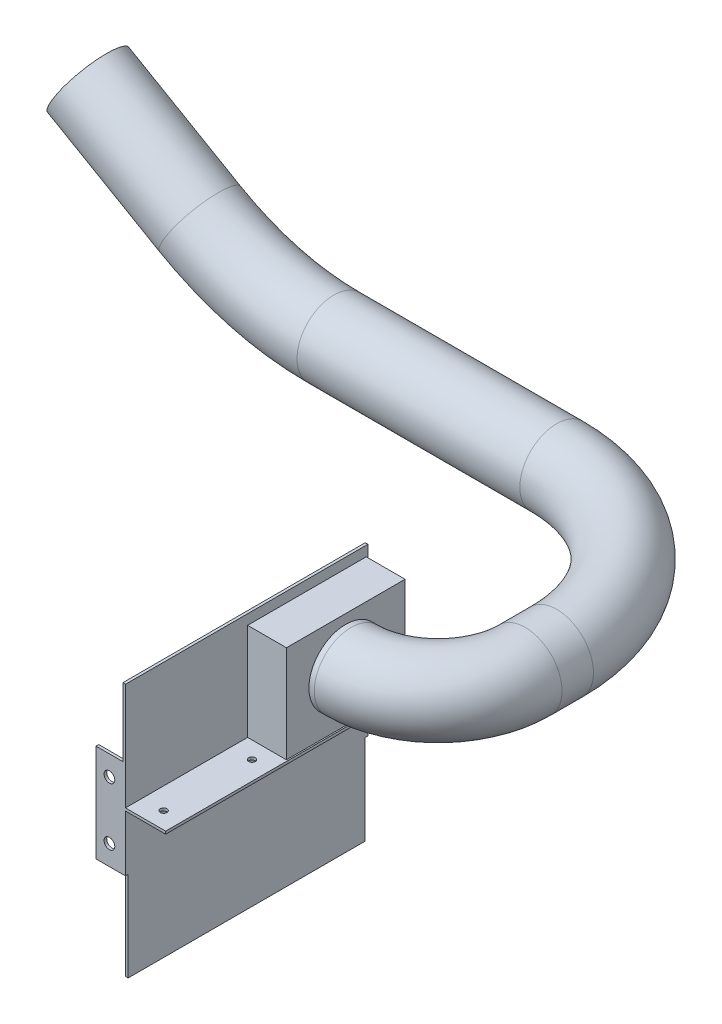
ISO-10303-21;
HEADER;
FILE_DESCRIPTION(('STEP AP214'),'2;1');
FILE_NAME('part.step','',(''),(''),'','','');
FILE_SCHEMA(('AUTOMOTIVE_DESIGN { 1 0 10303 214 1 1 1 1 }'));
ENDSEC;
DATA;
#1=APPLICATION_CONTEXT('core data for automotive mechanical design processes');
#2=APPLICATION_PROTOCOL_DEFINITION('international standard','automotive_design',2000,#1);
#3=PRODUCT_CONTEXT('',#1,'mechanical');
#4=PRODUCT('Part','Part','',(#3));
#5=PRODUCT_RELATED_PRODUCT_CATEGORY('part','',(#4));
#6=PRODUCT_DEFINITION_FORMATION('','',#4);
#7=PRODUCT_DEFINITION_CONTEXT('part definition',#1,'design');
#8=PRODUCT_DEFINITION('design','',#6,#7);
#9=PRODUCT_DEFINITION_SHAPE('','',#8);
#10=(LENGTH_UNIT() NAMED_UNIT(*) SI_UNIT(.MILLI.,.METRE.));
#11=(NAMED_UNIT(*) PLANE_ANGLE_UNIT() SI_UNIT($,.RADIAN.));
#12=(NAMED_UNIT(*) SI_UNIT($,.STERADIAN.) SOLID_ANGLE_UNIT());
#13=UNCERTAINTY_MEASURE_WITH_UNIT(LENGTH_MEASURE(1.E-05),#10,'distance_accuracy_value','');
#14=(GEOMETRIC_REPRESENTATION_CONTEXT(3) GLOBAL_UNCERTAINTY_ASSIGNED_CONTEXT((#13)) GLOBAL_UNIT_ASSIGNED_CONTEXT((#10,
#11,#12)) REPRESENTATION_CONTEXT('',''));
#15=CARTESIAN_POINT('',(0.,0.,0.));
#16=DIRECTION('',(0.,0.,1.));
#17=DIRECTION('',(1.,0.,0.));
#18=AXIS2_PLACEMENT_3D('',#15,#16,#17);
#19=CARTESIAN_POINT('',(31.,43.5,-0.7));
#20=DIRECTION('',(-1.,0.,0.));
#21=DIRECTION('',(0.,0.,1.));
#22=AXIS2_PLACEMENT_3D('',#19,#20,#21);
#23=PLANE('',#22);
#24=DIRECTION('',(0.,0.,-1.));
#25=VECTOR('',#24,1.);
#26=CARTESIAN_POINT('',(31.,-29.,-0.7));
#27=LINE('',#26,#25);
#28=CARTESIAN_POINT('',(31.,-29.,-0.699999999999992));
#29=VERTEX_POINT('',#28);
#30=CARTESIAN_POINT('',(31.,-29.,-89.3));
#31=VERTEX_POINT('',#30);
#32=EDGE_CURVE('E31',#29,#31,#27,.T.);
#33=ORIENTED_EDGE('',*,*,#32,.T.);
#34=DIRECTION('',(0.,-1.,0.));
#35=VECTOR('',#34,1.);
#36=CARTESIAN_POINT('',(31.,43.5,-89.3));
#37=LINE('',#36,#35);
#38=CARTESIAN_POINT('',(31.,43.5,-89.3));
#39=VERTEX_POINT('',#38);
#40=EDGE_CURVE('E190',#39,#31,#37,.T.);
#41=ORIENTED_EDGE('',*,*,#40,.F.);
#42=DIRECTION('',(0.,0.,-1.));
#43=VECTOR('',#42,1.);
#44=CARTESIAN_POINT('',(31.,43.5,-0.7));
#45=LINE('',#44,#43);
#46=CARTESIAN_POINT('',(31.,43.5,-0.7));
#47=VERTEX_POINT('',#46);
#48=EDGE_CURVE('E176',#47,#39,#45,.T.);
#49=ORIENTED_EDGE('',*,*,#48,.F.);
#50=DIRECTION('',(0.,-1.,0.));
#51=VECTOR('',#50,1.);
#52=CARTESIAN_POINT('',(31.,43.5,-0.7));
#53=LINE('',#52,#51);
#54=EDGE_CURVE('E168',#47,#29,#53,.T.);
#55=ORIENTED_EDGE('',*,*,#54,.T.);
#56=EDGE_LOOP('',(#33,#41,#49,#55));
#57=FACE_BOUND('',#56,.T.);
#58=CARTESIAN_POINT('',(31.,9.,-45.));
#59=DIRECTION('',(1.,0.,0.));
#60=DIRECTION('',(0.,0.,-1.));
#61=AXIS2_PLACEMENT_3D('',#58,#59,#60);
#62=CIRCLE('',#61,27.5);
#63=CARTESIAN_POINT('',(31.,9.,-72.5));
#64=VERTEX_POINT('',#63);
#65=EDGE_CURVE('E9',#64,#64,#62,.T.);
#66=ORIENTED_EDGE('',*,*,#65,.F.);
#67=EDGE_LOOP('',(#66));
#68=FACE_BOUND('',#67,.T.);
#69=ADVANCED_FACE('F14',(#57,#68),#23,.F.);
#70=CARTESIAN_POINT('',(-183.30848316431,-29.,90.5));
#71=DIRECTION('',(0.,-1.,0.));
#72=DIRECTION('',(0.,0.,-1.));
#73=AXIS2_PLACEMENT_3D('',#70,#71,#72);
#74=PLANE('',#73);
#75=CARTESIAN_POINT('',(18.,-29.,12.));
#76=DIRECTION('',(0.,1.,0.));
#77=DIRECTION('',(0.,0.,1.));
#78=AXIS2_PLACEMENT_3D('',#75,#76,#77);
#79=CIRCLE('',#78,2.5);
#80=CARTESIAN_POINT('',(18.,-29.,14.5));
#81=VERTEX_POINT('',#80);
#82=EDGE_CURVE('E238',#81,#81,#79,.T.);
#83=ORIENTED_EDGE('',*,*,#82,.F.);
#84=EDGE_LOOP('',(#83));
#85=FACE_BOUND('',#84,.T.);
#86=CARTESIAN_POINT('',(18.,-29.,78.));
#87=DIRECTION('',(0.,1.,0.));
#88=DIRECTION('',(0.,0.,1.));
#89=AXIS2_PLACEMENT_3D('',#86,#87,#88);
#90=CIRCLE('',#89,2.5);
#91=CARTESIAN_POINT('',(18.,-29.,80.5));
#92=VERTEX_POINT('',#91);
#93=EDGE_CURVE('E241',#92,#92,#90,.T.);
#94=ORIENTED_EDGE('',*,*,#93,.F.);
#95=EDGE_LOOP('',(#94));
#96=FACE_BOUND('',#95,.T.);
#97=DIRECTION('',(1.,0.,0.));
#98=VECTOR('',#97,1.);
#99=CARTESIAN_POINT('',(2.,-29.,-0.699999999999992));
#100=LINE('',#99,#98);
#101=CARTESIAN_POINT('',(2.,-29.,-0.699999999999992));
#102=VERTEX_POINT('',#101);
#103=EDGE_CURVE('E813',#102,#29,#100,.T.);
#104=ORIENTED_EDGE('',*,*,#103,.F.);
#105=DIRECTION('',(0.,0.,-1.));
#106=VECTOR('',#105,1.);
#107=CARTESIAN_POINT('',(2.,-29.,90.5));
#108=LINE('',#107,#106);
#109=CARTESIAN_POINT('',(2.,-29.,90.5));
#110=VERTEX_POINT('',#109);
#111=EDGE_CURVE('E165',#110,#102,#108,.T.);
#112=ORIENTED_EDGE('',*,*,#111,.F.);
#113=DIRECTION('',(1.,0.,0.));
#114=VECTOR('',#113,1.);
#115=CARTESIAN_POINT('',(-183.30848316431,-29.,90.5));
#116=LINE('',#115,#114);
#117=CARTESIAN_POINT('',(32.,-29.,90.5));
#118=VERTEX_POINT('',#117);
#119=EDGE_CURVE('E437',#110,#118,#116,.T.);
#120=ORIENTED_EDGE('',*,*,#119,.T.);
#121=DIRECTION('',(0.,0.,1.));
#122=VECTOR('',#121,1.);
#123=CARTESIAN_POINT('',(32.,-29.,90.5));
#124=LINE('',#123,#122);
#125=CARTESIAN_POINT('',(32.,-29.,-90.5));
#126=VERTEX_POINT('',#125);
#127=EDGE_CURVE('E261',#126,#118,#124,.T.);
#128=ORIENTED_EDGE('',*,*,#127,.F.);
#129=DIRECTION('',(1.,0.,0.));
#130=VECTOR('',#129,1.);
#131=CARTESIAN_POINT('',(-183.30848316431,-29.,-90.5));
#132=LINE('',#131,#130);
#133=CARTESIAN_POINT('',(2.,-29.,-90.5));
#134=VERTEX_POINT('',#133);
#135=EDGE_CURVE('E266',#134,#126,#132,.T.);
#136=ORIENTED_EDGE('',*,*,#135,.F.);
#137=CARTESIAN_POINT('',(2.,-29.,-89.3));
#138=VERTEX_POINT('',#137);
#139=EDGE_CURVE('E167',#138,#134,#108,.T.);
#140=ORIENTED_EDGE('',*,*,#139,.F.);
#141=DIRECTION('',(-1.,0.,0.));
#142=VECTOR('',#141,1.);
#143=CARTESIAN_POINT('',(2.,-29.,-89.3));
#144=LINE('',#143,#142);
#145=EDGE_CURVE('E36',#31,#138,#144,.T.);
#146=ORIENTED_EDGE('',*,*,#145,.F.);
#147=ORIENTED_EDGE('',*,*,#32,.F.);
#148=EDGE_LOOP('',(#104,#112,#120,#128,#136,#140,#146,#147));
#149=FACE_BOUND('',#148,.T.);
#150=ADVANCED_FACE('F291',(#85,#96,#149),#74,.F.);
#151=CARTESIAN_POINT('',(2.,51.,90.5));
#152=DIRECTION('',(-1.,0.,0.));
#153=DIRECTION('',(0.,0.,1.));
#154=AXIS2_PLACEMENT_3D('',#151,#152,#153);
#155=PLANE('',#154);
#156=DIRECTION('',(0.,-1.,0.));
#157=VECTOR('',#156,1.);
#158=CARTESIAN_POINT('',(2.,43.5,-0.699999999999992));
#159=LINE('',#158,#157);
#160=CARTESIAN_POINT('',(2.,43.5,-0.699999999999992));
#161=VERTEX_POINT('',#160);
#162=EDGE_CURVE('E158',#161,#102,#159,.T.);
#163=ORIENTED_EDGE('',*,*,#162,.F.);
#164=DIRECTION('',(0.,0.,1.));
#165=VECTOR('',#164,1.);
#166=CARTESIAN_POINT('',(2.,43.5,-0.699999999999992));
#167=LINE('',#166,#165);
#168=CARTESIAN_POINT('',(2.,43.5,-89.3));
#169=VERTEX_POINT('',#168);
#170=EDGE_CURVE('E162',#169,#161,#167,.T.);
#171=ORIENTED_EDGE('',*,*,#170,.F.);
#172=DIRECTION('',(0.,-1.,0.));
#173=VECTOR('',#172,1.);
#174=CARTESIAN_POINT('',(2.,43.5,-89.3));
#175=LINE('',#174,#173);
#176=EDGE_CURVE('E188',#169,#138,#175,.T.);
#177=ORIENTED_EDGE('',*,*,#176,.T.);
#178=ORIENTED_EDGE('',*,*,#139,.T.);
#179=DIRECTION('',(0.,-1.,0.));
#180=VECTOR('',#179,1.);
#181=CARTESIAN_POINT('',(2.,51.,-90.5));
#182=LINE('',#181,#180);
#183=CARTESIAN_POINT('',(2.,51.,-90.5));
#184=VERTEX_POINT('',#183);
#185=EDGE_CURVE('E209',#184,#134,#182,.T.);
#186=ORIENTED_EDGE('',*,*,#185,.F.);
#187=DIRECTION('',(0.,0.,-1.));
#188=VECTOR('',#187,1.);
#189=CARTESIAN_POINT('',(2.,51.,90.5));
#190=LINE('',#189,#188);
#191=CARTESIAN_POINT('',(2.,51.,90.5));
#192=VERTEX_POINT('',#191);
#193=EDGE_CURVE('E198',#192,#184,#190,.T.);
#194=ORIENTED_EDGE('',*,*,#193,.F.);
#195=DIRECTION('',(0.,-1.,0.));
#196=VECTOR('',#195,1.);
#197=CARTESIAN_POINT('',(2.,51.,90.5));
#198=LINE('',#197,#196);
#199=EDGE_CURVE('E212',#192,#110,#198,.T.);
#200=ORIENTED_EDGE('',*,*,#199,.T.);
#201=ORIENTED_EDGE('',*,*,#111,.T.);
#202=EDGE_LOOP('',(#163,#171,#177,#178,#186,#194,#200,#201));
#203=FACE_BOUND('',#202,.T.);
#204=ADVANCED_FACE('F160',(#203),#155,.F.);
#205=CARTESIAN_POINT('',(-20.,0.,90.5));
#206=DIRECTION('',(0.,1.,0.));
#207=DIRECTION('',(0.,0.,1.));
#208=AXIS2_PLACEMENT_3D('',#205,#206,#207);
#209=PLANE('',#208);
#210=DIRECTION('',(0.,0.,1.));
#211=VECTOR('',#210,1.);
#212=CARTESIAN_POINT('',(0.,0.,90.5));
#213=LINE('',#212,#211);
#214=CARTESIAN_POINT('',(0.,0.,-90.5));
#215=VERTEX_POINT('',#214);
#216=CARTESIAN_POINT('',(0.,0.,-88.5));
#217=VERTEX_POINT('',#216);
#218=EDGE_CURVE('E360',#215,#217,#213,.T.);
#219=ORIENTED_EDGE('',*,*,#218,.F.);
#220=DIRECTION('',(-1.,0.,0.));
#221=VECTOR('',#220,1.);
#222=CARTESIAN_POINT('',(2.,0.,-90.5));
#223=LINE('',#222,#221);
#224=CARTESIAN_POINT('',(-20.,0.,-90.5));
#225=VERTEX_POINT('',#224);
#226=EDGE_CURVE('E404',#215,#225,#223,.T.);
#227=ORIENTED_EDGE('',*,*,#226,.T.);
#228=DIRECTION('',(0.,0.,1.));
#229=VECTOR('',#228,1.);
#230=CARTESIAN_POINT('',(-20.,0.,-88.5));
#231=LINE('',#230,#229);
#232=CARTESIAN_POINT('',(-20.,0.,-88.5));
#233=VERTEX_POINT('',#232);
#234=EDGE_CURVE('E401',#225,#233,#231,.T.);
#235=ORIENTED_EDGE('',*,*,#234,.T.);
#236=DIRECTION('',(1.,0.,0.));
#237=VECTOR('',#236,1.);
#238=CARTESIAN_POINT('',(0.,0.,-88.5));
#239=LINE('',#238,#237);
#240=EDGE_CURVE('E399',#233,#217,#239,.T.);
#241=ORIENTED_EDGE('',*,*,#240,.T.);
#242=EDGE_LOOP('',(#219,#227,#235,#241));
#243=FACE_BOUND('',#242,.T.);
#244=ADVANCED_FACE('F313',(#243),#209,.T.);
#245=CARTESIAN_POINT('',(-20.,-140.,88.5));
#246=DIRECTION('',(-1.,0.,0.));
#247=DIRECTION('',(0.,0.,1.));
#248=AXIS2_PLACEMENT_3D('',#245,#246,#247);
#249=PLANE('',#248);
#250=DIRECTION('',(0.,0.,1.));
#251=VECTOR('',#250,1.);
#252=CARTESIAN_POINT('',(-20.,-73.,17.980499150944));
#253=LINE('',#252,#251);
#254=CARTESIAN_POINT('',(-20.,-73.,88.5));
#255=VERTEX_POINT('',#254);
#256=CARTESIAN_POINT('',(-20.,-73.,90.5));
#257=VERTEX_POINT('',#256);
#258=EDGE_CURVE('E426',#255,#257,#253,.T.);
#259=ORIENTED_EDGE('',*,*,#258,.T.);
#260=DIRECTION('',(0.,1.,0.));
#261=VECTOR('',#260,1.);
#262=CARTESIAN_POINT('',(-20.,-140.,90.5));
#263=LINE('',#262,#261);
#264=CARTESIAN_POINT('',(-20.,0.,90.5));
#265=VERTEX_POINT('',#264);
#266=EDGE_CURVE('E375',#257,#265,#263,.T.);
#267=ORIENTED_EDGE('',*,*,#266,.T.);
#268=DIRECTION('',(0.,0.,1.));
#269=VECTOR('',#268,1.);
#270=CARTESIAN_POINT('',(-20.,0.,88.5));
#271=LINE('',#270,#269);
#272=CARTESIAN_POINT('',(-20.,0.,88.5));
#273=VERTEX_POINT('',#272);
#274=EDGE_CURVE('E409',#273,#265,#271,.T.);
#275=ORIENTED_EDGE('',*,*,#274,.F.);
#276=DIRECTION('',(0.,1.,0.));
#277=VECTOR('',#276,1.);
#278=CARTESIAN_POINT('',(-20.,-140.,88.5));
#279=LINE('',#278,#277);
#280=EDGE_CURVE('E382',#255,#273,#279,.T.);
#281=ORIENTED_EDGE('',*,*,#280,.F.);
#282=EDGE_LOOP('',(#259,#267,#275,#281));
#283=FACE_BOUND('',#282,.T.);
#284=ADVANCED_FACE('F16',(#283),#249,.T.);
#285=CARTESIAN_POINT('',(-20.,-140.,88.5));
#286=DIRECTION('',(0.,0.,-1.));
#287=DIRECTION('',(-1.,0.,0.));
#288=AXIS2_PLACEMENT_3D('',#285,#286,#287);
#289=PLANE('',#288);
#290=CARTESIAN_POINT('',(-10.,-58.,88.5));
#291=DIRECTION('',(0.,0.,-1.));
#292=DIRECTION('',(-1.,0.,0.));
#293=AXIS2_PLACEMENT_3D('',#290,#291,#292);
#294=CIRCLE('',#293,4.);
#295=CARTESIAN_POINT('',(-14.,-58.,88.5));
#296=VERTEX_POINT('',#295);
#297=EDGE_CURVE('E217',#296,#296,#294,.T.);
#298=ORIENTED_EDGE('',*,*,#297,.F.);
#299=EDGE_LOOP('',(#298));
#300=FACE_BOUND('',#299,.T.);
#301=CARTESIAN_POINT('',(-10.,-15.,88.5));
#302=DIRECTION('',(0.,0.,-1.));
#303=DIRECTION('',(-1.,0.,0.));
#304=AXIS2_PLACEMENT_3D('',#301,#302,#303);
#305=CIRCLE('',#304,4.);
#306=CARTESIAN_POINT('',(-14.,-15.,88.5));
#307=VERTEX_POINT('',#306);
#308=EDGE_CURVE('E223',#307,#307,#305,.T.);
#309=ORIENTED_EDGE('',*,*,#308,.F.);
#310=EDGE_LOOP('',(#309));
#311=FACE_BOUND('',#310,.T.);
#312=DIRECTION('',(-1.,0.,0.));
#313=VECTOR('',#312,1.);
#314=CARTESIAN_POINT('',(2.,-73.,88.5));
#315=LINE('',#314,#313);
#316=CARTESIAN_POINT('',(0.,-73.,88.5));
#317=VERTEX_POINT('',#316);
#318=EDGE_CURVE('E434',#317,#255,#315,.T.);
#319=ORIENTED_EDGE('',*,*,#318,.T.);
#320=ORIENTED_EDGE('',*,*,#280,.T.);
#321=DIRECTION('',(-1.,0.,0.));
#322=VECTOR('',#321,1.);
#323=CARTESIAN_POINT('',(-20.,0.,88.5));
#324=LINE('',#323,#322);
#325=CARTESIAN_POINT('',(0.,0.,88.5));
#326=VERTEX_POINT('',#325);
#327=EDGE_CURVE('E396',#326,#273,#324,.T.);
#328=ORIENTED_EDGE('',*,*,#327,.F.);
#329=DIRECTION('',(0.,1.,0.));
#330=VECTOR('',#329,1.);
#331=CARTESIAN_POINT('',(0.,-140.,88.5));
#332=LINE('',#331,#330);
#333=EDGE_CURVE('E363',#317,#326,#332,.T.);
#334=ORIENTED_EDGE('',*,*,#333,.F.);
#335=EDGE_LOOP('',(#319,#320,#328,#334));
#336=FACE_BOUND('',#335,.T.);
#337=ADVANCED_FACE('F493',(#300,#311,#336),#289,.T.);
#338=CARTESIAN_POINT('',(0.,-140.,88.5));
#339=DIRECTION('',(-1.,0.,0.));
#340=DIRECTION('',(0.,0.,1.));
#341=AXIS2_PLACEMENT_3D('',#338,#339,#340);
#342=PLANE('',#341);
#343=ORIENTED_EDGE('',*,*,#333,.T.);
#344=DIRECTION('',(0.,0.,1.));
#345=VECTOR('',#344,1.);
#346=CARTESIAN_POINT('',(0.,0.,90.5));
#347=LINE('',#346,#345);
#348=CARTESIAN_POINT('',(0.,0.,90.5));
#349=VERTEX_POINT('',#348);
#350=EDGE_CURVE('E23',#326,#349,#347,.T.);
#351=ORIENTED_EDGE('',*,*,#350,.T.);
#352=DIRECTION('',(0.,-1.,0.));
#353=VECTOR('',#352,1.);
#354=CARTESIAN_POINT('',(0.,51.,90.5));
#355=LINE('',#354,#353);
#356=CARTESIAN_POINT('',(0.,51.,90.5));
#357=VERTEX_POINT('',#356);
#358=EDGE_CURVE('E204',#357,#349,#355,.T.);
#359=ORIENTED_EDGE('',*,*,#358,.F.);
#360=DIRECTION('',(0.,0.,1.));
#361=VECTOR('',#360,1.);
#362=CARTESIAN_POINT('',(0.,51.,90.5));
#363=LINE('',#362,#361);
#364=CARTESIAN_POINT('',(0.,51.,-90.5));
#365=VERTEX_POINT('',#364);
#366=EDGE_CURVE('E202',#365,#357,#363,.T.);
#367=ORIENTED_EDGE('',*,*,#366,.F.);
#368=DIRECTION('',(0.,-1.,0.));
#369=VECTOR('',#368,1.);
#370=CARTESIAN_POINT('',(0.,51.,-90.5));
#371=LINE('',#370,#369);
#372=EDGE_CURVE('E207',#365,#215,#371,.T.);
#373=ORIENTED_EDGE('',*,*,#372,.T.);
#374=ORIENTED_EDGE('',*,*,#218,.T.);
#375=DIRECTION('',(0.,1.,0.));
#376=VECTOR('',#375,1.);
#377=CARTESIAN_POINT('',(0.,-140.,-88.5));
#378=LINE('',#377,#376);
#379=CARTESIAN_POINT('',(0.,-73.,-88.5));
#380=VERTEX_POINT('',#379);
#381=EDGE_CURVE('E345',#380,#217,#378,.T.);
#382=ORIENTED_EDGE('',*,*,#381,.F.);
#383=CARTESIAN_POINT('',(0.,-140.,-88.5));
#384=VERTEX_POINT('',#383);
#385=EDGE_CURVE('E357',#384,#380,#378,.T.);
#386=ORIENTED_EDGE('',*,*,#385,.F.);
#387=DIRECTION('',(0.,0.,1.));
#388=VECTOR('',#387,1.);
#389=CARTESIAN_POINT('',(0.,-140.,88.5));
#390=LINE('',#389,#388);
#391=CARTESIAN_POINT('',(0.,-140.,88.5));
#392=VERTEX_POINT('',#391);
#393=EDGE_CURVE('E392',#384,#392,#390,.T.);
#394=ORIENTED_EDGE('',*,*,#393,.T.);
#395=EDGE_CURVE('E367',#392,#317,#332,.T.);
#396=ORIENTED_EDGE('',*,*,#395,.T.);
#397=EDGE_LOOP('',(#343,#351,#359,#367,#373,#374,#382,#386,#394,#396));
#398=FACE_BOUND('',#397,.T.);
#399=ADVANCED_FACE('F337',(#398),#342,.T.);
#400=CARTESIAN_POINT('',(0.,-140.,-88.5));
#401=DIRECTION('',(0.,0.,1.));
#402=DIRECTION('',(1.,0.,0.));
#403=AXIS2_PLACEMENT_3D('',#400,#401,#402);
#404=PLANE('',#403);
#405=CARTESIAN_POINT('',(-10.,-15.,-88.5));
#406=DIRECTION('',(0.,0.,1.));
#407=DIRECTION('',(1.,0.,0.));
#408=AXIS2_PLACEMENT_3D('',#405,#406,#407);
#409=CIRCLE('',#408,4.);
#410=CARTESIAN_POINT('',(-6.,-15.,-88.5));
#411=VERTEX_POINT('',#410);
#412=EDGE_CURVE('E229',#411,#411,#409,.T.);
#413=ORIENTED_EDGE('',*,*,#412,.F.);
#414=EDGE_LOOP('',(#413));
#415=FACE_BOUND('',#414,.T.);
#416=CARTESIAN_POINT('',(-10.,-58.,-88.5));
#417=DIRECTION('',(0.,0.,1.));
#418=DIRECTION('',(1.,0.,0.));
#419=AXIS2_PLACEMENT_3D('',#416,#417,#418);
#420=CIRCLE('',#419,4.);
#421=CARTESIAN_POINT('',(-6.,-58.,-88.5));
#422=VERTEX_POINT('',#421);
#423=EDGE_CURVE('E235',#422,#422,#420,.T.);
#424=ORIENTED_EDGE('',*,*,#423,.F.);
#425=EDGE_LOOP('',(#424));
#426=FACE_BOUND('',#425,.T.);
#427=DIRECTION('',(1.,0.,0.));
#428=VECTOR('',#427,1.);
#429=CARTESIAN_POINT('',(2.,-73.,-88.5));
#430=LINE('',#429,#428);
#431=CARTESIAN_POINT('',(-20.,-73.,-88.5));
#432=VERTEX_POINT('',#431);
#433=EDGE_CURVE('E342',#432,#380,#430,.T.);
#434=ORIENTED_EDGE('',*,*,#433,.T.);
#435=ORIENTED_EDGE('',*,*,#381,.T.);
#436=ORIENTED_EDGE('',*,*,#240,.F.);
#437=DIRECTION('',(0.,1.,0.));
#438=VECTOR('',#437,1.);
#439=CARTESIAN_POINT('',(-20.,-140.,-88.5));
#440=LINE('',#439,#438);
#441=EDGE_CURVE('E347',#432,#233,#440,.T.);
#442=ORIENTED_EDGE('',*,*,#441,.F.);
#443=EDGE_LOOP('',(#434,#435,#436,#442));
#444=FACE_BOUND('',#443,.T.);
#445=ADVANCED_FACE('F334',(#415,#426,#444),#404,.T.);
#446=CARTESIAN_POINT('',(-20.,-140.,-88.5));
#447=DIRECTION('',(-1.,0.,0.));
#448=DIRECTION('',(0.,0.,1.));
#449=AXIS2_PLACEMENT_3D('',#446,#447,#448);
#450=PLANE('',#449);
#451=DIRECTION('',(0.,0.,-1.));
#452=VECTOR('',#451,1.);
#453=CARTESIAN_POINT('',(-20.,-73.,-17.980499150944));
#454=LINE('',#453,#452);
#455=CARTESIAN_POINT('',(-20.,-73.,-90.5));
#456=VERTEX_POINT('',#455);
#457=EDGE_CURVE('E413',#432,#456,#454,.T.);
#458=ORIENTED_EDGE('',*,*,#457,.F.);
#459=ORIENTED_EDGE('',*,*,#441,.T.);
#460=ORIENTED_EDGE('',*,*,#234,.F.);
#461=DIRECTION('',(0.,1.,0.));
#462=VECTOR('',#461,1.);
#463=CARTESIAN_POINT('',(-20.,-140.,-90.5));
#464=LINE('',#463,#462);
#465=EDGE_CURVE('E364',#456,#225,#464,.T.);
#466=ORIENTED_EDGE('',*,*,#465,.F.);
#467=EDGE_LOOP('',(#458,#459,#460,#466));
#468=FACE_BOUND('',#467,.T.);
#469=ADVANCED_FACE('F336',(#468),#450,.T.);
#470=CARTESIAN_POINT('',(2.,-140.,-90.5));
#471=DIRECTION('',(0.,0.,-1.));
#472=DIRECTION('',(-1.,0.,0.));
#473=AXIS2_PLACEMENT_3D('',#470,#471,#472);
#474=PLANE('',#473);
#475=ORIENTED_EDGE('',*,*,#226,.F.);
#476=ORIENTED_EDGE('',*,*,#372,.F.);
#477=DIRECTION('',(-1.,0.,0.));
#478=VECTOR('',#477,1.);
#479=CARTESIAN_POINT('',(0.,51.,-90.5));
#480=LINE('',#479,#478);
#481=EDGE_CURVE('E200',#184,#365,#480,.T.);
#482=ORIENTED_EDGE('',*,*,#481,.F.);
#483=ORIENTED_EDGE('',*,*,#185,.T.);
#484=ORIENTED_EDGE('',*,*,#135,.T.);
#485=DIRECTION('',(0.,1.,0.));
#486=VECTOR('',#485,1.);
#487=CARTESIAN_POINT('',(32.,-29.,-90.5));
#488=LINE('',#487,#486);
#489=CARTESIAN_POINT('',(32.,-31.,-90.5));
#490=VERTEX_POINT('',#489);
#491=EDGE_CURVE('E443',#490,#126,#488,.T.);
#492=ORIENTED_EDGE('',*,*,#491,.F.);
#493=DIRECTION('',(-1.,0.,0.));
#494=VECTOR('',#493,1.);
#495=CARTESIAN_POINT('',(32.,-31.,-90.5));
#496=LINE('',#495,#494);
#497=CARTESIAN_POINT('',(2.,-31.,-90.5));
#498=VERTEX_POINT('',#497);
#499=EDGE_CURVE('E257',#490,#498,#496,.T.);
#500=ORIENTED_EDGE('',*,*,#499,.T.);
#501=DIRECTION('',(0.,1.,0.));
#502=VECTOR('',#501,1.);
#503=CARTESIAN_POINT('',(2.,-140.,-90.5));
#504=LINE('',#503,#502);
#505=CARTESIAN_POINT('',(2.,-73.,-90.5));
#506=VERTEX_POINT('',#505);
#507=EDGE_CURVE('E254',#506,#498,#504,.T.);
#508=ORIENTED_EDGE('',*,*,#507,.F.);
#509=DIRECTION('',(1.,0.,0.));
#510=VECTOR('',#509,1.);
#511=CARTESIAN_POINT('',(2.,-73.,-90.5));
#512=LINE('',#511,#510);
#513=EDGE_CURVE('E421',#456,#506,#512,.T.);
#514=ORIENTED_EDGE('',*,*,#513,.F.);
#515=ORIENTED_EDGE('',*,*,#465,.T.);
#516=EDGE_LOOP('',(#475,#476,#482,#483,#484,#492,#500,#508,#514,#515));
#517=FACE_BOUND('',#516,.T.);
#518=CARTESIAN_POINT('',(-10.,-15.,-90.5));
#519=DIRECTION('',(0.,0.,-1.));
#520=DIRECTION('',(-1.,0.,0.));
#521=AXIS2_PLACEMENT_3D('',#518,#519,#520);
#522=CIRCLE('',#521,4.);
#523=CARTESIAN_POINT('',(-14.,-15.,-90.5));
#524=VERTEX_POINT('',#523);
#525=EDGE_CURVE('E226',#524,#524,#522,.T.);
#526=ORIENTED_EDGE('',*,*,#525,.F.);
#527=EDGE_LOOP('',(#526));
#528=FACE_BOUND('',#527,.T.);
#529=CARTESIAN_POINT('',(-10.,-58.,-90.5));
#530=DIRECTION('',(0.,0.,-1.));
#531=DIRECTION('',(-1.,0.,0.));
#532=AXIS2_PLACEMENT_3D('',#529,#530,#531);
#533=CIRCLE('',#532,4.);
#534=CARTESIAN_POINT('',(-14.,-58.,-90.5));
#535=VERTEX_POINT('',#534);
#536=EDGE_CURVE('E232',#535,#535,#533,.T.);
#537=ORIENTED_EDGE('',*,*,#536,.F.);
#538=EDGE_LOOP('',(#537));
#539=FACE_BOUND('',#538,.T.);
#540=ADVANCED_FACE('F460',(#517,#528,#539),#474,.T.);
#541=CARTESIAN_POINT('',(2.,-140.,90.5));
#542=DIRECTION('',(1.,0.,0.));
#543=DIRECTION('',(0.,0.,-1.));
#544=AXIS2_PLACEMENT_3D('',#541,#542,#543);
#545=PLANE('',#544);
#546=DIRECTION('',(0.,0.,-1.));
#547=VECTOR('',#546,1.);
#548=CARTESIAN_POINT('',(2.,-31.,90.5));
#549=LINE('',#548,#547);
#550=CARTESIAN_POINT('',(2.,-31.,90.5));
#551=VERTEX_POINT('',#550);
#552=EDGE_CURVE('E250',#551,#498,#549,.T.);
#553=ORIENTED_EDGE('',*,*,#552,.F.);
#554=DIRECTION('',(0.,1.,0.));
#555=VECTOR('',#554,1.);
#556=CARTESIAN_POINT('',(2.,-140.,90.5));
#557=LINE('',#556,#555);
#558=CARTESIAN_POINT('',(2.,-73.,90.5));
#559=VERTEX_POINT('',#558);
#560=EDGE_CURVE('E377',#559,#551,#557,.T.);
#561=ORIENTED_EDGE('',*,*,#560,.F.);
#562=DIRECTION('',(0.,0.,1.));
#563=VECTOR('',#562,1.);
#564=CARTESIAN_POINT('',(2.,-73.,17.980499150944));
#565=LINE('',#564,#563);
#566=CARTESIAN_POINT('',(2.,-73.,88.5));
#567=VERTEX_POINT('',#566);
#568=EDGE_CURVE('E423',#567,#559,#565,.T.);
#569=ORIENTED_EDGE('',*,*,#568,.F.);
#570=DIRECTION('',(0.,1.,0.));
#571=VECTOR('',#570,1.);
#572=CARTESIAN_POINT('',(2.,-140.,88.5));
#573=LINE('',#572,#571);
#574=CARTESIAN_POINT('',(2.,-140.,88.5));
#575=VERTEX_POINT('',#574);
#576=EDGE_CURVE('E425',#575,#567,#573,.T.);
#577=ORIENTED_EDGE('',*,*,#576,.F.);
#578=DIRECTION('',(0.,0.,-1.));
#579=VECTOR('',#578,1.);
#580=CARTESIAN_POINT('',(2.,-140.,90.5));
#581=LINE('',#580,#579);
#582=CARTESIAN_POINT('',(2.,-140.,-88.5));
#583=VERTEX_POINT('',#582);
#584=EDGE_CURVE('E394',#575,#583,#581,.T.);
#585=ORIENTED_EDGE('',*,*,#584,.T.);
#586=DIRECTION('',(0.,-1.,0.));
#587=VECTOR('',#586,1.);
#588=CARTESIAN_POINT('',(2.,-140.,-88.5));
#589=LINE('',#588,#587);
#590=CARTESIAN_POINT('',(2.,-73.,-88.5));
#591=VERTEX_POINT('',#590);
#592=EDGE_CURVE('E412',#591,#583,#589,.T.);
#593=ORIENTED_EDGE('',*,*,#592,.F.);
#594=DIRECTION('',(0.,0.,-1.));
#595=VECTOR('',#594,1.);
#596=CARTESIAN_POINT('',(2.,-73.,-17.980499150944));
#597=LINE('',#596,#595);
#598=EDGE_CURVE('E351',#591,#506,#597,.T.);
#599=ORIENTED_EDGE('',*,*,#598,.T.);
#600=ORIENTED_EDGE('',*,*,#507,.T.);
#601=EDGE_LOOP('',(#553,#561,#569,#577,#585,#593,#599,#600));
#602=FACE_BOUND('',#601,.T.);
#603=ADVANCED_FACE('F479',(#602),#545,.T.);
#604=CARTESIAN_POINT('',(-20.,-140.,90.5));
#605=DIRECTION('',(0.,0.,1.));
#606=DIRECTION('',(1.,0.,0.));
#607=AXIS2_PLACEMENT_3D('',#604,#605,#606);
#608=PLANE('',#607);
#609=CARTESIAN_POINT('',(-10.,-58.,90.5));
#610=DIRECTION('',(0.,0.,1.));
#611=DIRECTION('',(1.,0.,0.));
#612=AXIS2_PLACEMENT_3D('',#609,#610,#611);
#613=CIRCLE('',#612,4.);
#614=CARTESIAN_POINT('',(-6.,-58.,90.5));
#615=VERTEX_POINT('',#614);
#616=EDGE_CURVE('E214',#615,#615,#613,.T.);
#617=ORIENTED_EDGE('',*,*,#616,.F.);
#618=EDGE_LOOP('',(#617));
#619=FACE_BOUND('',#618,.T.);
#620=CARTESIAN_POINT('',(-10.,-15.,90.5));
#621=DIRECTION('',(0.,0.,1.));
#622=DIRECTION('',(1.,0.,0.));
#623=AXIS2_PLACEMENT_3D('',#620,#621,#622);
#624=CIRCLE('',#623,4.);
#625=CARTESIAN_POINT('',(-6.,-15.,90.5));
#626=VERTEX_POINT('',#625);
#627=EDGE_CURVE('E220',#626,#626,#624,.T.);
#628=ORIENTED_EDGE('',*,*,#627,.F.);
#629=EDGE_LOOP('',(#628));
#630=FACE_BOUND('',#629,.T.);
#631=ORIENTED_EDGE('',*,*,#358,.T.);
#632=DIRECTION('',(1.,0.,0.));
#633=VECTOR('',#632,1.);
#634=CARTESIAN_POINT('',(-20.,0.,90.5));
#635=LINE('',#634,#633);
#636=EDGE_CURVE('E406',#265,#349,#635,.T.);
#637=ORIENTED_EDGE('',*,*,#636,.F.);
#638=ORIENTED_EDGE('',*,*,#266,.F.);
#639=DIRECTION('',(-1.,0.,0.));
#640=VECTOR('',#639,1.);
#641=CARTESIAN_POINT('',(2.,-73.,90.5));
#642=LINE('',#641,#640);
#643=EDGE_CURVE('E435',#559,#257,#642,.T.);
#644=ORIENTED_EDGE('',*,*,#643,.F.);
#645=ORIENTED_EDGE('',*,*,#560,.T.);
#646=DIRECTION('',(-1.,0.,0.));
#647=VECTOR('',#646,1.);
#648=CARTESIAN_POINT('',(32.,-31.,90.5));
#649=LINE('',#648,#647);
#650=CARTESIAN_POINT('',(32.,-31.,90.5));
#651=VERTEX_POINT('',#650);
#652=EDGE_CURVE('E260',#651,#551,#649,.T.);
#653=ORIENTED_EDGE('',*,*,#652,.F.);
#654=DIRECTION('',(0.,-1.,0.));
#655=VECTOR('',#654,1.);
#656=CARTESIAN_POINT('',(32.,-29.,90.5));
#657=LINE('',#656,#655);
#658=EDGE_CURVE('E247',#118,#651,#657,.T.);
#659=ORIENTED_EDGE('',*,*,#658,.F.);
#660=ORIENTED_EDGE('',*,*,#119,.F.);
#661=ORIENTED_EDGE('',*,*,#199,.F.);
#662=DIRECTION('',(1.,0.,0.));
#663=VECTOR('',#662,1.);
#664=CARTESIAN_POINT('',(0.,51.,90.5));
#665=LINE('',#664,#663);
#666=EDGE_CURVE('E195',#357,#192,#665,.T.);
#667=ORIENTED_EDGE('',*,*,#666,.F.);
#668=EDGE_LOOP('',(#631,#637,#638,#644,#645,#653,#659,#660,#661,#667));
#669=FACE_BOUND('',#668,.T.);
#670=ADVANCED_FACE('F453',(#619,#630,#669),#608,.T.);
#671=CARTESIAN_POINT('',(-20.,-140.,90.5));
#672=DIRECTION('',(0.,1.,0.));
#673=DIRECTION('',(0.,0.,1.));
#674=AXIS2_PLACEMENT_3D('',#671,#672,#673);
#675=PLANE('',#674);
#676=ORIENTED_EDGE('',*,*,#584,.F.);
#677=DIRECTION('',(-1.,0.,0.));
#678=VECTOR('',#677,1.);
#679=CARTESIAN_POINT('',(-20.,-140.,88.5));
#680=LINE('',#679,#678);
#681=EDGE_CURVE('E380',#575,#392,#680,.T.);
#682=ORIENTED_EDGE('',*,*,#681,.T.);
#683=ORIENTED_EDGE('',*,*,#393,.F.);
#684=DIRECTION('',(-1.,0.,0.));
#685=VECTOR('',#684,1.);
#686=CARTESIAN_POINT('',(2.,-140.,-88.5));
#687=LINE('',#686,#685);
#688=EDGE_CURVE('E415',#583,#384,#687,.T.);
#689=ORIENTED_EDGE('',*,*,#688,.F.);
#690=EDGE_LOOP('',(#676,#682,#683,#689));
#691=FACE_BOUND('',#690,.T.);
#692=ADVANCED_FACE('F498',(#691),#675,.F.);
#693=ORIENTED_EDGE('',*,*,#350,.F.);
#694=ORIENTED_EDGE('',*,*,#327,.T.);
#695=ORIENTED_EDGE('',*,*,#274,.T.);
#696=ORIENTED_EDGE('',*,*,#636,.T.);
#697=EDGE_LOOP('',(#693,#694,#695,#696));
#698=FACE_BOUND('',#697,.T.);
#699=ADVANCED_FACE('F474',(#698),#209,.T.);
#700=CARTESIAN_POINT('',(0.,-140.,-88.5));
#701=DIRECTION('',(0.,0.,1.));
#702=DIRECTION('',(1.,0.,0.));
#703=AXIS2_PLACEMENT_3D('',#700,#701,#702);
#704=PLANE('',#703);
#705=ORIENTED_EDGE('',*,*,#385,.T.);
#706=EDGE_CURVE('E352',#380,#591,#430,.T.);
#707=ORIENTED_EDGE('',*,*,#706,.T.);
#708=ORIENTED_EDGE('',*,*,#592,.T.);
#709=ORIENTED_EDGE('',*,*,#688,.T.);
#710=EDGE_LOOP('',(#705,#707,#708,#709));
#711=FACE_BOUND('',#710,.T.);
#712=ADVANCED_FACE('F497',(#711),#704,.F.);
#713=CARTESIAN_POINT('',(2.,-73.,-17.980499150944));
#714=DIRECTION('',(0.,1.,0.));
#715=DIRECTION('',(0.,0.,1.));
#716=AXIS2_PLACEMENT_3D('',#713,#714,#715);
#717=PLANE('',#716);
#718=ORIENTED_EDGE('',*,*,#457,.T.);
#719=ORIENTED_EDGE('',*,*,#513,.T.);
#720=ORIENTED_EDGE('',*,*,#598,.F.);
#721=ORIENTED_EDGE('',*,*,#706,.F.);
#722=ORIENTED_EDGE('',*,*,#433,.F.);
#723=EDGE_LOOP('',(#718,#719,#720,#721,#722));
#724=FACE_BOUND('',#723,.T.);
#725=ADVANCED_FACE('F502',(#724),#717,.F.);
#726=CARTESIAN_POINT('',(-20.,-140.,88.5));
#727=DIRECTION('',(0.,0.,-1.));
#728=DIRECTION('',(-1.,0.,0.));
#729=AXIS2_PLACEMENT_3D('',#726,#727,#728);
#730=PLANE('',#729);
#731=ORIENTED_EDGE('',*,*,#395,.F.);
#732=ORIENTED_EDGE('',*,*,#681,.F.);
#733=ORIENTED_EDGE('',*,*,#576,.T.);
#734=EDGE_CURVE('E429',#567,#317,#315,.T.);
#735=ORIENTED_EDGE('',*,*,#734,.T.);
#736=EDGE_LOOP('',(#731,#732,#733,#735));
#737=FACE_BOUND('',#736,.T.);
#738=ADVANCED_FACE('F534',(#737),#730,.F.);
#739=CARTESIAN_POINT('',(2.,-73.,17.980499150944));
#740=DIRECTION('',(0.,1.,0.));
#741=DIRECTION('',(0.,0.,1.));
#742=AXIS2_PLACEMENT_3D('',#739,#740,#741);
#743=PLANE('',#742);
#744=ORIENTED_EDGE('',*,*,#568,.T.);
#745=ORIENTED_EDGE('',*,*,#643,.T.);
#746=ORIENTED_EDGE('',*,*,#258,.F.);
#747=ORIENTED_EDGE('',*,*,#318,.F.);
#748=ORIENTED_EDGE('',*,*,#734,.F.);
#749=EDGE_LOOP('',(#744,#745,#746,#747,#748));
#750=FACE_BOUND('',#749,.T.);
#751=ADVANCED_FACE('F542',(#750),#743,.F.);
#752=CARTESIAN_POINT('',(32.,-31.,90.5));
#753=DIRECTION('',(0.,1.,0.));
#754=DIRECTION('',(0.,0.,1.));
#755=AXIS2_PLACEMENT_3D('',#752,#753,#754);
#756=PLANE('',#755);
#757=CARTESIAN_POINT('',(18.,-31.,12.));
#758=DIRECTION('',(0.,1.,0.));
#759=DIRECTION('',(0.,0.,1.));
#760=AXIS2_PLACEMENT_3D('',#757,#758,#759);
#761=CIRCLE('',#760,2.5);
#762=CARTESIAN_POINT('',(18.,-31.,14.5));
#763=VERTEX_POINT('',#762);
#764=EDGE_CURVE('E18',#763,#763,#761,.T.);
#765=ORIENTED_EDGE('',*,*,#764,.T.);
#766=EDGE_LOOP('',(#765));
#767=FACE_BOUND('',#766,.T.);
#768=CARTESIAN_POINT('',(18.,-31.,78.));
#769=DIRECTION('',(0.,1.,0.));
#770=DIRECTION('',(0.,0.,1.));
#771=AXIS2_PLACEMENT_3D('',#768,#769,#770);
#772=CIRCLE('',#771,2.5);
#773=CARTESIAN_POINT('',(18.,-31.,80.5));
#774=VERTEX_POINT('',#773);
#775=EDGE_CURVE('E244',#774,#774,#772,.T.);
#776=ORIENTED_EDGE('',*,*,#775,.T.);
#777=EDGE_LOOP('',(#776));
#778=FACE_BOUND('',#777,.T.);
#779=ORIENTED_EDGE('',*,*,#552,.T.);
#780=ORIENTED_EDGE('',*,*,#499,.F.);
#781=DIRECTION('',(0.,0.,-1.));
#782=VECTOR('',#781,1.);
#783=CARTESIAN_POINT('',(32.,-31.,90.5));
#784=LINE('',#783,#782);
#785=EDGE_CURVE('E445',#651,#490,#784,.T.);
#786=ORIENTED_EDGE('',*,*,#785,.F.);
#787=ORIENTED_EDGE('',*,*,#652,.T.);
#788=EDGE_LOOP('',(#779,#780,#786,#787));
#789=FACE_BOUND('',#788,.T.);
#790=ADVANCED_FACE('F271',(#767,#778,#789),#756,.F.);
#791=CARTESIAN_POINT('',(32.,-31.,90.5));
#792=DIRECTION('',(1.,0.,0.));
#793=DIRECTION('',(0.,0.,-1.));
#794=AXIS2_PLACEMENT_3D('',#791,#792,#793);
#795=PLANE('',#794);
#796=ORIENTED_EDGE('',*,*,#658,.T.);
#797=ORIENTED_EDGE('',*,*,#785,.T.);
#798=ORIENTED_EDGE('',*,*,#491,.T.);
#799=ORIENTED_EDGE('',*,*,#127,.T.);
#800=EDGE_LOOP('',(#796,#797,#798,#799));
#801=FACE_BOUND('',#800,.T.);
#802=ADVANCED_FACE('F277',(#801),#795,.T.);
#803=CARTESIAN_POINT('',(18.,-29.,78.));
#804=DIRECTION('',(0.,1.,0.));
#805=DIRECTION('',(0.,0.,1.));
#806=AXIS2_PLACEMENT_3D('',#803,#804,#805);
#807=CYLINDRICAL_SURFACE('',#806,2.5);
#808=ORIENTED_EDGE('',*,*,#93,.T.);
#809=EDGE_LOOP('',(#808));
#810=FACE_BOUND('',#809,.T.);
#811=ORIENTED_EDGE('',*,*,#775,.F.);
#812=EDGE_LOOP('',(#811));
#813=FACE_BOUND('',#812,.T.);
#814=ADVANCED_FACE('F274',(#810,#813),#807,.F.);
#815=CARTESIAN_POINT('',(18.,-29.,12.));
#816=DIRECTION('',(0.,1.,0.));
#817=DIRECTION('',(0.,0.,1.));
#818=AXIS2_PLACEMENT_3D('',#815,#816,#817);
#819=CYLINDRICAL_SURFACE('',#818,2.5);
#820=ORIENTED_EDGE('',*,*,#82,.T.);
#821=EDGE_LOOP('',(#820));
#822=FACE_BOUND('',#821,.T.);
#823=ORIENTED_EDGE('',*,*,#764,.F.);
#824=EDGE_LOOP('',(#823));
#825=FACE_BOUND('',#824,.T.);
#826=ADVANCED_FACE('F276',(#822,#825),#819,.F.);
#827=CARTESIAN_POINT('',(-10.,-58.,-90.5));
#828=DIRECTION('',(0.,0.,-1.));
#829=DIRECTION('',(-1.,0.,0.));
#830=AXIS2_PLACEMENT_3D('',#827,#828,#829);
#831=CYLINDRICAL_SURFACE('',#830,4.);
#832=ORIENTED_EDGE('',*,*,#536,.T.);
#833=EDGE_LOOP('',(#832));
#834=FACE_BOUND('',#833,.T.);
#835=ORIENTED_EDGE('',*,*,#423,.T.);
#836=EDGE_LOOP('',(#835));
#837=FACE_BOUND('',#836,.T.);
#838=ADVANCED_FACE('F284',(#834,#837),#831,.F.);
#839=CARTESIAN_POINT('',(-10.,-15.,-90.5));
#840=DIRECTION('',(0.,0.,-1.));
#841=DIRECTION('',(-1.,0.,0.));
#842=AXIS2_PLACEMENT_3D('',#839,#840,#841);
#843=CYLINDRICAL_SURFACE('',#842,4.);
#844=ORIENTED_EDGE('',*,*,#525,.T.);
#845=EDGE_LOOP('',(#844));
#846=FACE_BOUND('',#845,.T.);
#847=ORIENTED_EDGE('',*,*,#412,.T.);
#848=EDGE_LOOP('',(#847));
#849=FACE_BOUND('',#848,.T.);
#850=ADVANCED_FACE('F320',(#846,#849),#843,.F.);
#851=CARTESIAN_POINT('',(-10.,-15.,90.5));
#852=DIRECTION('',(0.,0.,1.));
#853=DIRECTION('',(1.,0.,0.));
#854=AXIS2_PLACEMENT_3D('',#851,#852,#853);
#855=CYLINDRICAL_SURFACE('',#854,4.);
#856=ORIENTED_EDGE('',*,*,#627,.T.);
#857=EDGE_LOOP('',(#856));
#858=FACE_BOUND('',#857,.T.);
#859=ORIENTED_EDGE('',*,*,#308,.T.);
#860=EDGE_LOOP('',(#859));
#861=FACE_BOUND('',#860,.T.);
#862=ADVANCED_FACE('F316',(#858,#861),#855,.F.);
#863=CARTESIAN_POINT('',(-10.,-58.,90.5));
#864=DIRECTION('',(0.,0.,1.));
#865=DIRECTION('',(1.,0.,0.));
#866=AXIS2_PLACEMENT_3D('',#863,#864,#865);
#867=CYLINDRICAL_SURFACE('',#866,4.);
#868=ORIENTED_EDGE('',*,*,#616,.T.);
#869=EDGE_LOOP('',(#868));
#870=FACE_BOUND('',#869,.T.);
#871=ORIENTED_EDGE('',*,*,#297,.T.);
#872=EDGE_LOOP('',(#871));
#873=FACE_BOUND('',#872,.T.);
#874=ADVANCED_FACE('F309',(#870,#873),#867,.F.);
#875=CARTESIAN_POINT('',(2.,51.,90.5));
#876=DIRECTION('',(0.,1.,0.));
#877=DIRECTION('',(0.,0.,1.));
#878=AXIS2_PLACEMENT_3D('',#875,#876,#877);
#879=PLANE('',#878);
#880=ORIENTED_EDGE('',*,*,#666,.T.);
#881=ORIENTED_EDGE('',*,*,#193,.T.);
#882=ORIENTED_EDGE('',*,*,#481,.T.);
#883=ORIENTED_EDGE('',*,*,#366,.T.);
#884=EDGE_LOOP('',(#880,#881,#882,#883));
#885=FACE_BOUND('',#884,.T.);
#886=ADVANCED_FACE('F306',(#885),#879,.T.);
#887=CARTESIAN_POINT('',(2.,43.5,-0.699999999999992));
#888=DIRECTION('',(0.,0.,-1.));
#889=DIRECTION('',(-1.,0.,0.));
#890=AXIS2_PLACEMENT_3D('',#887,#888,#889);
#891=PLANE('',#890);
#892=ORIENTED_EDGE('',*,*,#103,.T.);
#893=ORIENTED_EDGE('',*,*,#54,.F.);
#894=DIRECTION('',(1.,0.,0.));
#895=VECTOR('',#894,1.);
#896=CARTESIAN_POINT('',(2.,43.5,-0.699999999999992));
#897=LINE('',#896,#895);
#898=EDGE_CURVE('E171',#161,#47,#897,.T.);
#899=ORIENTED_EDGE('',*,*,#898,.F.);
#900=ORIENTED_EDGE('',*,*,#162,.T.);
#901=EDGE_LOOP('',(#892,#893,#899,#900));
#902=FACE_BOUND('',#901,.T.);
#903=ADVANCED_FACE('F172',(#902),#891,.F.);
#904=CARTESIAN_POINT('',(2.,43.5,-89.3));
#905=DIRECTION('',(0.,0.,1.));
#906=DIRECTION('',(1.,0.,0.));
#907=AXIS2_PLACEMENT_3D('',#904,#905,#906);
#908=PLANE('',#907);
#909=ORIENTED_EDGE('',*,*,#145,.T.);
#910=ORIENTED_EDGE('',*,*,#176,.F.);
#911=DIRECTION('',(-1.,0.,0.));
#912=VECTOR('',#911,1.);
#913=CARTESIAN_POINT('',(2.,43.5,-89.3));
#914=LINE('',#913,#912);
#915=EDGE_CURVE('E180',#39,#169,#914,.T.);
#916=ORIENTED_EDGE('',*,*,#915,.F.);
#917=ORIENTED_EDGE('',*,*,#40,.T.);
#918=EDGE_LOOP('',(#909,#910,#916,#917));
#919=FACE_BOUND('',#918,.T.);
#920=ADVANCED_FACE('F302',(#919),#908,.F.);
#921=CARTESIAN_POINT('',(2.,43.5,-0.699999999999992));
#922=DIRECTION('',(0.,-1.,0.));
#923=DIRECTION('',(0.,0.,-1.));
#924=AXIS2_PLACEMENT_3D('',#921,#922,#923);
#925=PLANE('',#924);
#926=ORIENTED_EDGE('',*,*,#170,.T.);
#927=ORIENTED_EDGE('',*,*,#898,.T.);
#928=ORIENTED_EDGE('',*,*,#48,.T.);
#929=ORIENTED_EDGE('',*,*,#915,.T.);
#930=EDGE_LOOP('',(#926,#927,#928,#929));
#931=FACE_BOUND('',#930,.T.);
#932=ADVANCED_FACE('F178',(#931),#925,.F.);
#933=CARTESIAN_POINT('',(-20.,9.,-253.5));
#934=DIRECTION('',(-1.,0.,0.));
#935=DIRECTION('',(0.,0.,1.));
#936=AXIS2_PLACEMENT_3D('',#933,#934,#935);
#937=CYLINDRICAL_SURFACE('',#936,27.5);
#938=CARTESIAN_POINT('',(-20.,9.,-253.5));
#939=DIRECTION('',(-1.,0.,0.));
#940=DIRECTION('',(0.,0.,1.));
#941=AXIS2_PLACEMENT_3D('',#938,#939,#940);
#942=CIRCLE('',#941,27.5);
#943=CARTESIAN_POINT('',(-20.,9.,-281.));
#944=VERTEX_POINT('',#943);
#945=EDGE_CURVE('E810',#944,#944,#942,.T.);
#946=ORIENTED_EDGE('',*,*,#945,.T.);
#947=EDGE_LOOP('',(#946));
#948=FACE_BOUND('',#947,.T.);
#949=CARTESIAN_POINT('',(-186.410161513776,9.,-253.5));
#950=DIRECTION('',(-1.,0.,0.));
#951=DIRECTION('',(0.,0.,1.));
#952=AXIS2_PLACEMENT_3D('',#949,#950,#951);
#953=CIRCLE('',#952,27.5);
#954=CARTESIAN_POINT('',(-186.410161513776,-18.5,-253.5));
#955=VERTEX_POINT('',#954);
#956=EDGE_CURVE('E801',#955,#955,#953,.T.);
#957=ORIENTED_EDGE('',*,*,#956,.F.);
#958=EDGE_LOOP('',(#957));
#959=FACE_BOUND('',#958,.T.);
#960=ADVANCED_FACE('F573',(#948,#959),#937,.T.);
#961=CARTESIAN_POINT('',(-20.,9.,-133.5));
#962=DIRECTION('',(0.,1.,0.));
#963=DIRECTION('',(0.,0.,1.));
#964=AXIS2_PLACEMENT_3D('',#961,#962,#963);
#965=TOROIDAL_SURFACE('',#964,120.,27.5);
#966=CARTESIAN_POINT('',(100.,9.,-133.5));
#967=DIRECTION('',(0.,0.,-1.));
#968=DIRECTION('',(-1.,0.,0.));
#969=AXIS2_PLACEMENT_3D('',#966,#967,#968);
#970=CIRCLE('',#969,27.5);
#971=CARTESIAN_POINT('',(127.5,9.,-133.5));
#972=VERTEX_POINT('',#971);
#973=EDGE_CURVE('E807',#972,#972,#970,.T.);
#974=CARTESIAN_POINT('',(-20.,9.,-133.5));
#975=DIRECTION('',(0.,1.,0.));
#976=DIRECTION('',(0.,0.,1.));
#977=AXIS2_PLACEMENT_3D('',#974,#975,#976);
#978=CIRCLE('',#977,147.5);
#979=EDGE_CURVE('',#972,#944,#978,.T.);
#980=ORIENTED_EDGE('',*,*,#973,.T.);
#981=ORIENTED_EDGE('',*,*,#945,.F.);
#982=ORIENTED_EDGE('',*,*,#979,.T.);
#983=ORIENTED_EDGE('',*,*,#979,.F.);
#984=EDGE_LOOP('',(#980,#982,#981,#983));
#985=FACE_BOUND('',#984,.T.);
#986=ADVANCED_FACE('F580',(#985),#965,.T.);
#987=CARTESIAN_POINT('',(100.,9.,-110.));
#988=DIRECTION('',(0.,0.,-1.));
#989=DIRECTION('',(-1.,0.,0.));
#990=AXIS2_PLACEMENT_3D('',#987,#988,#989);
#991=CYLINDRICAL_SURFACE('',#990,27.5);
#992=CARTESIAN_POINT('',(100.,9.,-110.));
#993=DIRECTION('',(0.,0.,-1.));
#994=DIRECTION('',(-1.,0.,0.));
#995=AXIS2_PLACEMENT_3D('',#992,#993,#994);
#996=CIRCLE('',#995,27.5);
#997=CARTESIAN_POINT('',(127.5,9.,-110.));
#998=VERTEX_POINT('',#997);
#999=EDGE_CURVE('E798',#998,#998,#996,.T.);
#1000=ORIENTED_EDGE('',*,*,#999,.T.);
#1001=EDGE_LOOP('',(#1000));
#1002=FACE_BOUND('',#1001,.T.);
#1003=ORIENTED_EDGE('',*,*,#973,.F.);
#1004=EDGE_LOOP('',(#1003));
#1005=FACE_BOUND('',#1004,.T.);
#1006=ADVANCED_FACE('F589',(#1002,#1005),#991,.T.);
#1007=CARTESIAN_POINT('',(35.,9.,-110.));
#1008=DIRECTION('',(0.,1.,0.));
#1009=DIRECTION('',(0.,0.,1.));
#1010=AXIS2_PLACEMENT_3D('',#1007,#1008,#1009);
#1011=TOROIDAL_SURFACE('',#1010,65.,27.5);
#1012=CARTESIAN_POINT('',(35.,9.,-45.));
#1013=DIRECTION('',(1.,0.,0.));
#1014=DIRECTION('',(0.,0.,-1.));
#1015=AXIS2_PLACEMENT_3D('',#1012,#1013,#1014);
#1016=CIRCLE('',#1015,27.5);
#1017=CARTESIAN_POINT('',(35.,9.,-17.5));
#1018=VERTEX_POINT('',#1017);
#1019=EDGE_CURVE('E794',#1018,#1018,#1016,.T.);
#1020=CARTESIAN_POINT('',(35.,9.,-110.));
#1021=DIRECTION('',(0.,1.,0.));
#1022=DIRECTION('',(0.,0.,1.));
#1023=AXIS2_PLACEMENT_3D('',#1020,#1021,#1022);
#1024=CIRCLE('',#1023,92.5);
#1025=EDGE_CURVE('',#1018,#998,#1024,.T.);
#1026=ORIENTED_EDGE('',*,*,#1019,.T.);
#1027=ORIENTED_EDGE('',*,*,#999,.F.);
#1028=ORIENTED_EDGE('',*,*,#1025,.T.);
#1029=ORIENTED_EDGE('',*,*,#1025,.F.);
#1030=EDGE_LOOP('',(#1026,#1028,#1027,#1029));
#1031=FACE_BOUND('',#1030,.T.);
#1032=ADVANCED_FACE('F598',(#1031),#1011,.T.);
#1033=CARTESIAN_POINT('',(35.,9.,-45.));
#1034=DIRECTION('',(-1.,0.,0.));
#1035=DIRECTION('',(0.,0.,1.));
#1036=AXIS2_PLACEMENT_3D('',#1033,#1034,#1035);
#1037=CYLINDRICAL_SURFACE('',#1036,27.5);
#1038=ORIENTED_EDGE('',*,*,#1019,.F.);
#1039=EDGE_LOOP('',(#1038));
#1040=FACE_BOUND('',#1039,.T.);
#1041=ORIENTED_EDGE('',*,*,#65,.T.);
#1042=EDGE_LOOP('',(#1041));
#1043=FACE_BOUND('',#1042,.T.);
#1044=ADVANCED_FACE('F607',(#1040,#1043),#1037,.T.);
#1045=CARTESIAN_POINT('',(-286.410161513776,35.7949192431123,-253.5));
#1046=DIRECTION('',(-0.866025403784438,0.5,0.));
#1047=DIRECTION('',(-0.5,-0.866025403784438,0.));
#1048=AXIS2_PLACEMENT_3D('',#1045,#1046,#1047);
#1049=CYLINDRICAL_SURFACE('',#1048,27.5);
#1050=CARTESIAN_POINT('',(-286.410161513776,35.7949192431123,-253.5));
#1051=DIRECTION('',(-0.866025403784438,0.5,0.));
#1052=DIRECTION('',(0.,0.,1.));
#1053=AXIS2_PLACEMENT_3D('',#1050,#1051,#1052);
#1054=CIRCLE('',#1053,27.5);
#1055=CARTESIAN_POINT('',(-300.160161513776,11.9792206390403,-253.5));
#1056=VERTEX_POINT('',#1055);
#1057=EDGE_CURVE('E795',#1056,#1056,#1054,.T.);
#1058=CARTESIAN_POINT('',(-369.903810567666,84.,-253.5));
#1059=DIRECTION('',(-0.866025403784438,0.5,0.));
#1060=DIRECTION('',(0.,0.,1.));
#1061=AXIS2_PLACEMENT_3D('',#1058,#1059,#1060);
#1062=CIRCLE('',#1061,27.5);
#1063=CARTESIAN_POINT('',(-383.653810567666,60.1843013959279,-253.5));
#1064=VERTEX_POINT('',#1063);
#1065=EDGE_CURVE('E792',#1064,#1064,#1062,.T.);
#1066=CARTESIAN_POINT('',(-300.160161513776,11.9792206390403,-253.5));
#1067=CARTESIAN_POINT('',(-301.029887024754,12.4813568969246,-253.5));
#1068=CARTESIAN_POINT('',(-301.899612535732,12.9834931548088,-253.5));
#1069=CARTESIAN_POINT('',(-303.639063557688,13.9877656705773,-253.5));
#1070=CARTESIAN_POINT('',(-304.508789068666,14.4899019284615,-253.5));
#1071=CARTESIAN_POINT('',(-306.248240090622,15.49417444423,-253.5));
#1072=CARTESIAN_POINT('',(-307.1179656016,15.9963107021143,-253.5));
#1073=CARTESIAN_POINT('',(-308.857416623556,17.0005832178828,-253.5));
#1074=CARTESIAN_POINT('',(-309.727142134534,17.502719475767,-253.5));
#1075=CARTESIAN_POINT('',(-311.46659315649,18.5069919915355,-253.5));
#1076=CARTESIAN_POINT('',(-312.336318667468,19.0091282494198,-253.5));
#1077=CARTESIAN_POINT('',(-314.075769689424,20.0134007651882,-253.5));
#1078=CARTESIAN_POINT('',(-314.945495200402,20.5155370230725,-253.5));
#1079=CARTESIAN_POINT('',(-316.684946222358,21.519809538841,-253.5));
#1080=CARTESIAN_POINT('',(-317.554671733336,22.0219457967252,-253.5));
#1081=CARTESIAN_POINT('',(-319.294122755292,23.0262183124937,-253.5));
#1082=CARTESIAN_POINT('',(-320.16384826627,23.528354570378,-253.5));
#1083=CARTESIAN_POINT('',(-321.903299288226,24.5326270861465,-253.5));
#1084=CARTESIAN_POINT('',(-322.773024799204,25.0347633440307,-253.5));
#1085=CARTESIAN_POINT('',(-324.51247582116,26.0390358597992,-253.5));
#1086=CARTESIAN_POINT('',(-325.382201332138,26.5411721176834,-253.5));
#1087=CARTESIAN_POINT('',(-327.121652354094,27.5454446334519,-253.5));
#1088=CARTESIAN_POINT('',(-327.991377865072,28.0475808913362,-253.5));
#1089=CARTESIAN_POINT('',(-329.730828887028,29.0518534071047,-253.5));
#1090=CARTESIAN_POINT('',(-330.600554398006,29.5539896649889,-253.5));
#1091=CARTESIAN_POINT('',(-332.340005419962,30.5582621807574,-253.5));
#1092=CARTESIAN_POINT('',(-333.20973093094,31.0603984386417,-253.5));
#1093=CARTESIAN_POINT('',(-334.949181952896,32.0646709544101,-253.5));
#1094=CARTESIAN_POINT('',(-335.818907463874,32.5668072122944,-253.5));
#1095=CARTESIAN_POINT('',(-337.55835848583,33.5710797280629,-253.5));
#1096=CARTESIAN_POINT('',(-338.428083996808,34.0732159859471,-253.5));
#1097=CARTESIAN_POINT('',(-340.167535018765,35.0774885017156,-253.5));
#1098=CARTESIAN_POINT('',(-341.037260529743,35.5796247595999,-253.5));
#1099=CARTESIAN_POINT('',(-342.776711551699,36.5838972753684,-253.5));
#1100=CARTESIAN_POINT('',(-343.646437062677,37.0860335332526,-253.5));
#1101=CARTESIAN_POINT('',(-345.385888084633,38.0903060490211,-253.5));
#1102=CARTESIAN_POINT('',(-346.255613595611,38.5924423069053,-253.5));
#1103=CARTESIAN_POINT('',(-347.995064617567,39.5967148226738,-253.5));
#1104=CARTESIAN_POINT('',(-348.864790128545,40.0988510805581,-253.5));
#1105=CARTESIAN_POINT('',(-350.604241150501,41.1031235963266,-253.5));
#1106=CARTESIAN_POINT('',(-351.473966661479,41.6052598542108,-253.5));
#1107=CARTESIAN_POINT('',(-353.213417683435,42.6095323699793,-253.5));
#1108=CARTESIAN_POINT('',(-354.083143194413,43.1116686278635,-253.5));
#1109=CARTESIAN_POINT('',(-355.822594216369,44.115941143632,-253.5));
#1110=CARTESIAN_POINT('',(-356.692319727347,44.6180774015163,-253.5));
#1111=CARTESIAN_POINT('',(-358.431770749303,45.6223499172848,-253.5));
#1112=CARTESIAN_POINT('',(-359.301496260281,46.124486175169,-253.5));
#1113=CARTESIAN_POINT('',(-361.040947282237,47.1287586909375,-253.5));
#1114=CARTESIAN_POINT('',(-361.910672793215,47.6308949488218,-253.5));
#1115=CARTESIAN_POINT('',(-363.650123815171,48.6351674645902,-253.5));
#1116=CARTESIAN_POINT('',(-364.519849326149,49.1373037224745,-253.5));
#1117=CARTESIAN_POINT('',(-366.259300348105,50.141576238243,-253.5));
#1118=CARTESIAN_POINT('',(-367.129025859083,50.6437124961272,-253.5));
#1119=CARTESIAN_POINT('',(-368.868476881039,51.6479850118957,-253.5));
#1120=CARTESIAN_POINT('',(-369.738202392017,52.15012126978,-253.5));
#1121=CARTESIAN_POINT('',(-371.477653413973,53.1543937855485,-253.5));
#1122=CARTESIAN_POINT('',(-372.347378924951,53.6565300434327,-253.5));
#1123=CARTESIAN_POINT('',(-374.086829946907,54.6608025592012,-253.5));
#1124=CARTESIAN_POINT('',(-374.956555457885,55.1629388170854,-253.5));
#1125=CARTESIAN_POINT('',(-376.696006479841,56.1672113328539,-253.5));
#1126=CARTESIAN_POINT('',(-377.565731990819,56.6693475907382,-253.5));
#1127=CARTESIAN_POINT('',(-379.305183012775,57.6736201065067,-253.5));
#1128=CARTESIAN_POINT('',(-380.174908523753,58.1757563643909,-253.5));
#1129=CARTESIAN_POINT('',(-381.914359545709,59.1800288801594,-253.5));
#1130=CARTESIAN_POINT('',(-382.784085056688,59.6821651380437,-253.5));
#1131=CARTESIAN_POINT('',(-383.653810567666,60.1843013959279,-253.5));
#1132=B_SPLINE_CURVE_WITH_KNOTS('',3,(#1066,#1067,#1068,#1069,#1070,#1071,#1072,#1073,#1074,
#1075,#1076,#1077,#1078,#1079,#1080,#1081,#1082,#1083,#1084,#1085,#1086,#1087,#1088,#1089,#1090,
#1091,#1092,#1093,#1094,#1095,#1096,#1097,#1098,#1099,#1100,#1101,#1102,#1103,#1104,#1105,#1106,
#1107,#1108,#1109,#1110,#1111,#1112,#1113,#1114,#1115,#1116,#1117,#1118,#1119,#1120,#1121,#1122,
#1123,#1124,#1125,#1126,#1127,#1128,#1129,#1130,#1131),.UNSPECIFIED.,.F.,.F.,(4,2,2,2,2,2,2,2,2,
2,2,2,2,2,2,2,2,2,2,2,2,2,2,2,2,2,2,2,2,2,2,2,4),(0.,3.01281754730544,6.02563509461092,
9.0384526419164,12.0512701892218,15.0640877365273,18.0769052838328,21.0897228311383,
24.1025403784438,27.1153579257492,30.1281754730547,33.1409930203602,36.1538105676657,
39.1666281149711,42.1794456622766,45.1922632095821,48.2050807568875,51.217898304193,
54.2307158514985,57.243533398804,60.2563509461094,63.2691684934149,66.2819860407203,
69.2948035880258,72.3076211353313,75.3204386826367,78.3332562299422,81.3460737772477,
84.3588913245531,87.3717088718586,90.3845264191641,93.3973439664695,96.4101615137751),.UNSPECIFIED.);
#1133=EDGE_CURVE('BSEAM616',#1056,#1064,#1132,.T.);
#1134=ORIENTED_EDGE('',*,*,#1057,.T.);
#1135=ORIENTED_EDGE('',*,*,#1065,.F.);
#1136=ORIENTED_EDGE('',*,*,#1133,.T.);
#1137=ORIENTED_EDGE('',*,*,#1133,.F.);
#1138=EDGE_LOOP('',(#1134,#1136,#1135,#1137));
#1139=FACE_BOUND('',#1138,.T.);
#1140=ADVANCED_FACE('F616',(#1139),#1049,.T.);
#1141=CARTESIAN_POINT('',(-186.410161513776,209.,-253.5));
#1142=DIRECTION('',(0.,0.,-1.));
#1143=DIRECTION('',(-1.,0.,0.));
#1144=AXIS2_PLACEMENT_3D('',#1141,#1142,#1143);
#1145=TOROIDAL_SURFACE('',#1144,200.,27.5);
#1146=CARTESIAN_POINT('',(-186.410161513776,209.,-253.5));
#1147=DIRECTION('',(0.,0.,-1.));
#1148=DIRECTION('',(-1.,0.,0.));
#1149=AXIS2_PLACEMENT_3D('',#1146,#1147,#1148);
#1150=CIRCLE('',#1149,227.5);
#1151=EDGE_CURVE('',#955,#1056,#1150,.T.);
#1152=ORIENTED_EDGE('',*,*,#956,.T.);
#1153=ORIENTED_EDGE('',*,*,#1057,.F.);
#1154=ORIENTED_EDGE('',*,*,#1151,.T.);
#1155=ORIENTED_EDGE('',*,*,#1151,.F.);
#1156=EDGE_LOOP('',(#1152,#1154,#1153,#1155));
#1157=FACE_BOUND('',#1156,.T.);
#1158=ADVANCED_FACE('F625',(#1157),#1145,.T.);
#1159=CARTESIAN_POINT('',(-369.903810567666,84.,-253.5));
#1160=DIRECTION('',(-0.866025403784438,0.5,0.));
#1161=DIRECTION('',(0.,0.,1.));
#1162=AXIS2_PLACEMENT_3D('',#1159,#1160,#1161);
#1163=PLANE('',#1162);
#1164=ORIENTED_EDGE('',*,*,#1065,.T.);
#1165=EDGE_LOOP('',(#1164));
#1166=FACE_BOUND('',#1165,.T.);
#1167=ADVANCED_FACE('F634',(#1166),#1163,.T.);
#1168=CLOSED_SHELL('',(#69,#150,#204,#244,#284,#337,#399,#445,#469,#540,#603,#670,#692,#699,
#712,#725,#738,#751,#790,#802,#814,#826,#838,#850,#862,#874,#886,#903,#920,#932,#960,#986,#1006,
#1032,#1044,#1140,#1158,#1167));
#1169=MANIFOLD_SOLID_BREP('B1',#1168);
#1170=ADVANCED_BREP_SHAPE_REPRESENTATION('',(#18,#1169),#14);
#1171=SHAPE_DEFINITION_REPRESENTATION(#9,#1170);
ENDSEC;
END-ISO-10303-21;
